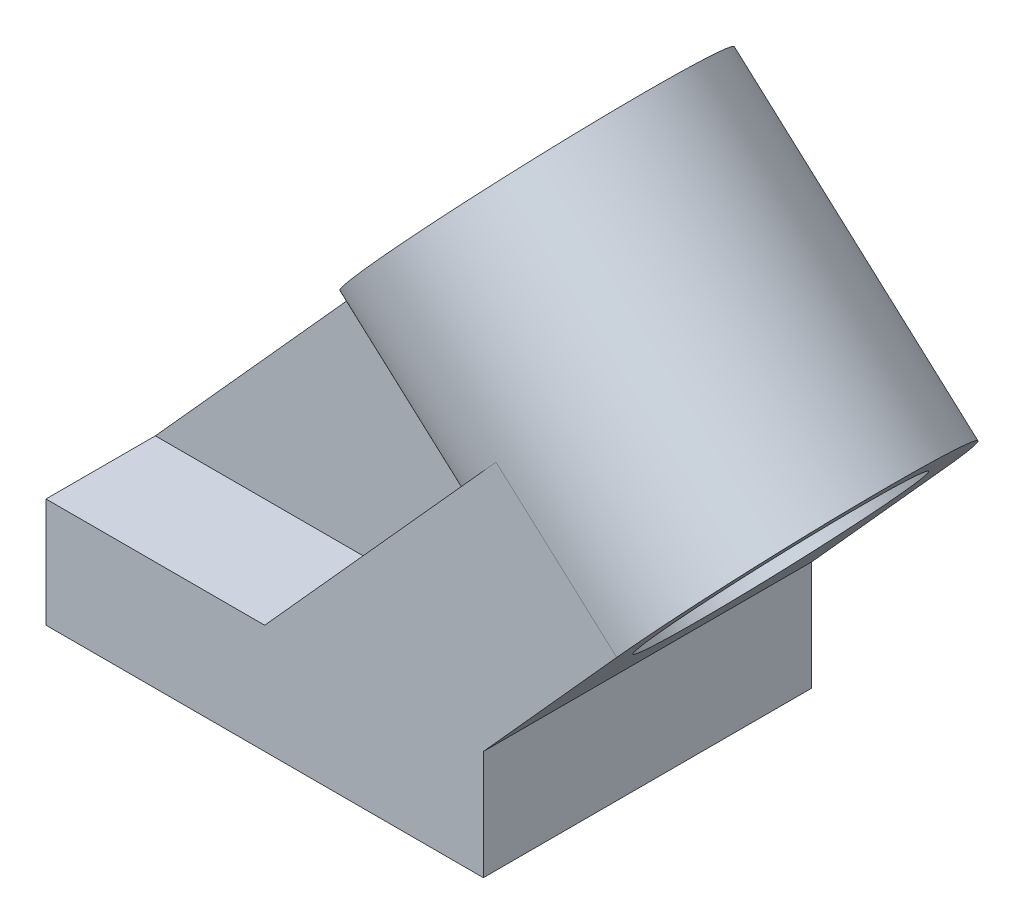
from build123d import *

# Parameters (mm, degrees)
BOSS_EXTRUDE1_DEPTH = 76.2
SKETCH2_R           = 38.1
BOSS_EXTRUDE2_DEPTH = 76.2
SKETCH3_R           = 28.575
CUT_EXTRUDE1_DEPTH  = 226.213994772
RIB1_REACH          = 216.003
SKETCH4_WALL_W      = 506.206497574
SKETCH4_WALL_H      = 25.4


with BuildPart() as part:
    # Sketch1 → Boss-Extrude1 (new body)
    with BuildSketch(Plane.XY):
        Polygon((0, 0), (101.6, 0), (101.6, 25.4), (132.591674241, 59.819741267), (104.536651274, 85.08059741), (50.8, 25.4), (0, 25.4), align=None)
    extrude(amount=BOSS_EXTRUDE1_DEPTH)

    # Sketch2 → Boss-Extrude2 (add)
    with BuildSketch(Plane(origin=(43.479617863, -39.149223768, 0), x_dir=(0, 0, -1), z_dir=(0.7431448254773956, -0.6691306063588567, 0))):
        with Locations(Location((-38.1, 133.175878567, 0), (0, 0, 90))):
            Circle(SKETCH2_R)
    extrude(amount=-BOSS_EXTRUDE2_DEPTH)

    # Sketch3 → Cut-Extrude1 (cut, through all)
    with BuildSketch(Plane(origin=(43.479617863, -39.149223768, 0), x_dir=(0, 0, -1), z_dir=(0.7431448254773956, -0.6691306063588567, 0))):
        with Locations(Location((-38.1, 133.175878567, 0), (0, 0, 90))):
            Circle(SKETCH3_R)
    extrude(amount=-CUT_EXTRUDE1_DEPTH, mode=Mode.SUBTRACT)

    # Sketch4 wall → Rib1 (add, up to next)
    with BuildSketch(Plane(origin=(25.493876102, 53.71381785, 38.1), x_dir=(0.669130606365, 0.743144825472, 0), z_dir=(-0.743144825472, 0.669130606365, 0)), mode=Mode.PRIVATE) as rib1_sk1:
        Rectangle(SKETCH4_WALL_W, SKETCH4_WALL_H)
    rib1_tool1 = extrude(rib1_sk1.sketch, amount=-RIB1_REACH, mode=Mode.PRIVATE) - part.part
    add(rib1_tool1.solids().sort_by_distance((25.493876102, 53.71381785, 38.1))[0])


solid = part.part
